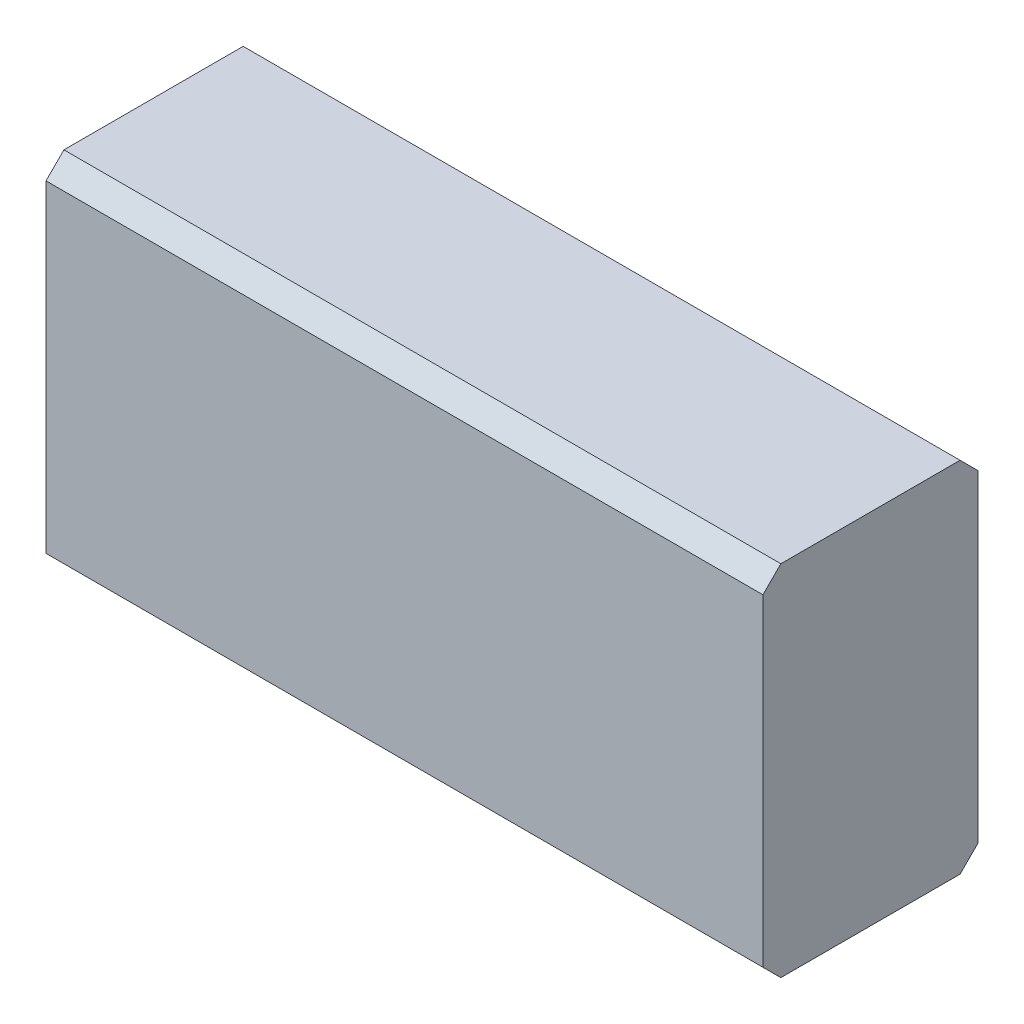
from build123d import *

# Parameters (mm, degrees)
EXTRUDE1_DEPTH = 3
SKETCH2_W      = 10
SKETCH2_H      = 5
EXTRUDE2_DEPTH = 3
EXTRUDE3_DEPTH = 3
CHAMFER1_SIZE  = 0.25


with BuildPart() as part:
    # Sketch1 → Extrude1 (new body)
    with BuildSketch(Plane.XY):
        with BuildLine():
            Line((0, 2.5), (-5, 2.5))
            ThreePointArc((-5, 2.5), (-7.5, 0), (-5, -2.5))
            Line((-5, -2.5), (0, -2.5))
            ThreePointArc((0, -2.5), (2.5, 0), (0, 2.5))
        make_face()
    extrude(amount=EXTRUDE1_DEPTH)

    # Sketch2 → Extrude2 (add)
    with BuildSketch(Plane.XY):
        with Locations((-2.5, 0)):
            Rectangle(SKETCH2_W, SKETCH2_H)
    extrude(amount=EXTRUDE2_DEPTH)

    # Sketch3 → Extrude3 (add)
    with BuildSketch(Plane.XY):
        with BuildLine():
            Line((-5, -2.5), (2.5, -2.5))
            Line((2.5, -2.5), (2.5, 2.5))
            Line((2.5, 2.5), (-5, 2.5))
            ThreePointArc((-5, 2.5), (-7.5, 0), (-5, -2.5))
        make_face()
    extrude(amount=EXTRUDE3_DEPTH)

    # Chamfer1
    chamfer1_edges = [part.edges().sort_by_distance(p)[0] for p in [
        (-2.5, -2.5, 3),
        (-2.5, -2.5, 0),
        (-2.5, 2.5, 0),
        (-2.5, 2.5, 3),
    ]]
    chamfer(chamfer1_edges, length=CHAMFER1_SIZE)


solid = part.part
